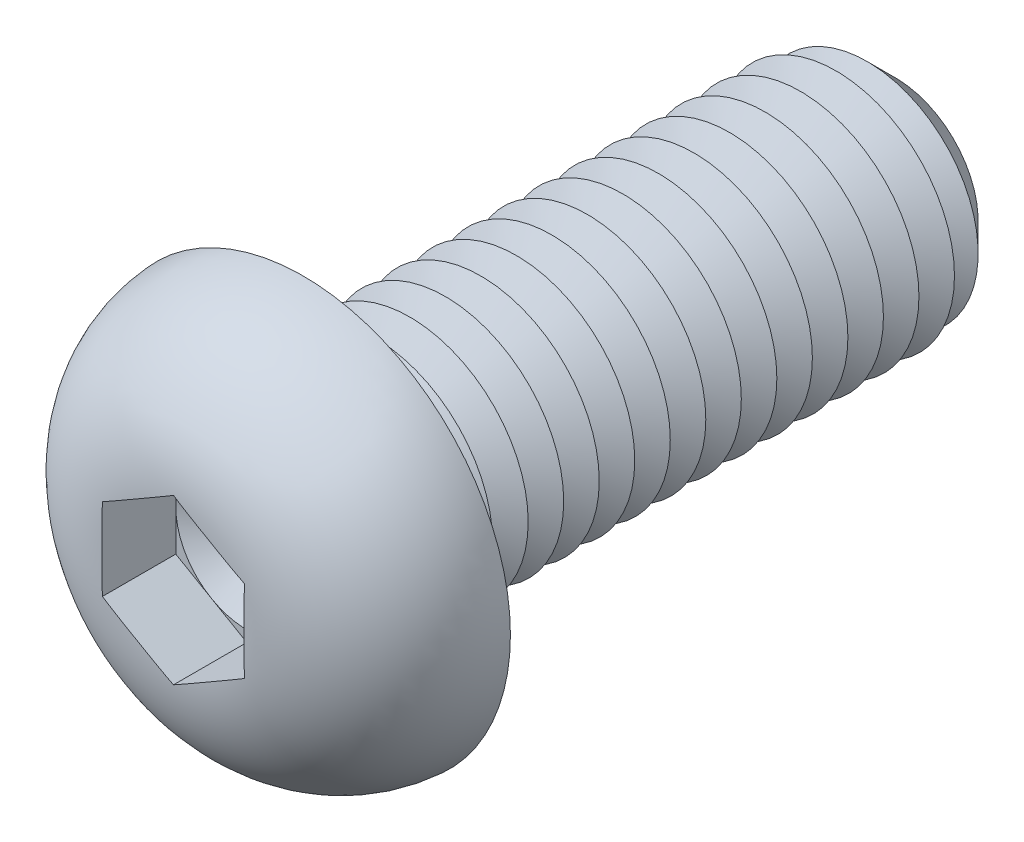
from build123d import *

# Parameters (mm, degrees)
CUT_EXTRUDE1_DEPTH  = 3.12
SKETCH4_R           = 5
BOSS_EXTRUDE1_DEPTH = 25
CHAMFER1_SIZE       = 1.5
LPATTERN1_COUNT     = 15
LPATTERN1_PITCH     = 1.5
FILLET2_R           = 0.6


with BuildPart() as part:
    # Sketch2 → Revolve1 (revolve)
    with BuildSketch(Plane(origin=(0, 0, 0), x_dir=(0, 0, -1), z_dir=(1, 0, 0)), mode=Mode.PRIVATE) as revolve1_sk:
        with BuildLine():
            Line((0, 0), (-5.5, 0))
            Line((-5.5, 0), (-5.5, 2.957763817))
            ThreePointArc((-5.5, 2.957763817), (-3.905948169, 6.951508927), (0, 8.75))
            Line((0, 8.75), (0, 0))
        make_face()
    revolve(revolve1_sk.sketch.rotate(Axis((0, 0, 47.934239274), (0, 0, -1)), 90), axis=Axis((0, 0, 47.934239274), (0, 0, -1)))

    # Sketch3 → Cut-Extrude1 (cut)
    with BuildSketch(Plane.XY.offset(5.5)):
        Polygon((0, 3.464101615), (-3, 1.732050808), (-3, -1.732050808), (0, -3.464101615), (3, -1.732050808), (3, 1.732050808), align=None)
    extrude(amount=-CUT_EXTRUDE1_DEPTH, mode=Mode.SUBTRACT)

    # Sketch4 → Boss-Extrude1 (add)
    with BuildSketch(Plane(origin=(0, 0, 0), x_dir=(-1, 0, 0), z_dir=(0, 0, -1))):
        with Locations(Location((0, 0, 0), (0, 0, 180))):
            Circle(SKETCH4_R)
    extrude(amount=BOSS_EXTRUDE1_DEPTH)

    # Chamfer1
    chamfer1_edges = [part.edges().sort_by_distance(p)[0] for p in [
        (-5, 0, -25),
    ]]
    chamfer(chamfer1_edges, length=CHAMFER1_SIZE)

    # Sketch5 → Cut-Revolve1 (revolve, cut)
    with BuildSketch(Plane(origin=(0, 0, 0), x_dir=(0, 0, -1), z_dir=(1, 0, 0)), mode=Mode.PRIVATE) as cut_revolve1_sk:
        Polygon((1.5, 5), (3, 5), (2.25, 3.700961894), align=None)
    cut_revolve1 = revolve(cut_revolve1_sk.sketch.rotate(Axis((0, 0, 47.934239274), (0, 0, -1)), 90), axis=Axis((0, 0, 47.934239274), (0, 0, -1)), mode=Mode.SUBTRACT)

    # LPattern1: Cut-Revolve1 ×15
    with Locations(*[(0, 0, -i * LPATTERN1_PITCH) for i in range(1, LPATTERN1_COUNT)]):
        add(cut_revolve1, mode=Mode.SUBTRACT)

    # Fillet2
    fillet2_edges = [part.edges().sort_by_distance(p)[0] for p in [
        (-5, 0, 0),
    ]]
    fillet(fillet2_edges, radius=FILLET2_R)

    # Cut-Extrude2 cone 1 section (on through the dimple's axis) → Cut-Extrude2 (revolve, cut)
    with BuildSketch(Plane(origin=(0, 0, 2.38), x_dir=(0, -1, 0), z_dir=(1, 0, 0))):
        Polygon((0, 0), (3, 0), (0, 1.732050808), align=None)
    revolve(axis=Axis((0, 0, 2.38), (0, 0, -1)), mode=Mode.SUBTRACT)


solid = part.part
